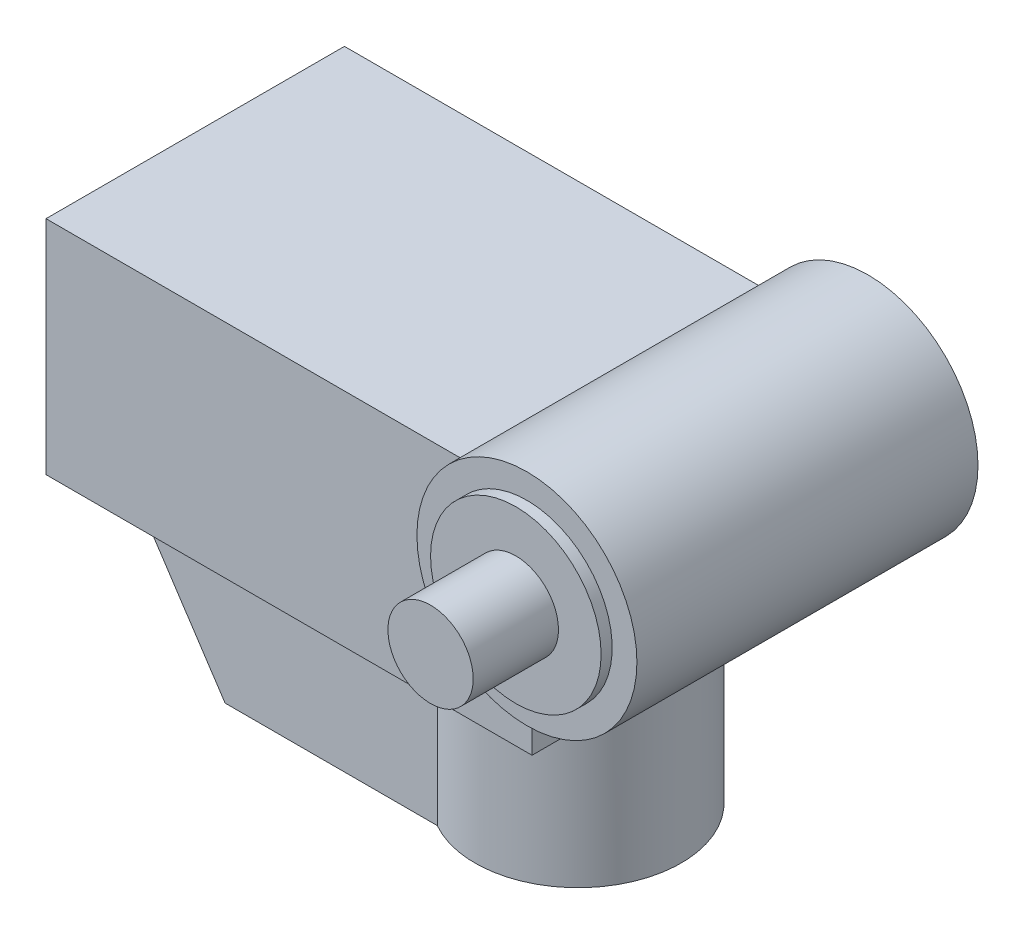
from build123d import *

# Parameters (mm, degrees)
EXTRUDE1_DEPTH     = 98.5
SKETCH2_R          = 25
CUT_EXTRUDE1_DEPTH = 50
CUT_EXTRUDE2_DEPTH = 266.803498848
SKETCH4_W          = 285
SKETCH4_H          = 175
EXTRUDE3_DEPTH     = 130
SKETCH5_R          = 64.5
EXTRUDE4_DEPTH     = 12.5
EXTRUDE5_START     = -187.5
SKETCH5_2_R        = 64.5
EXTRUDE5_DEPTH     = 187.5
SKETCH6_R          = 50
EXTRUDE6_DEPTH     = 6.5
SKETCH7_R          = 25
EXTRUDE7_DEPTH     = 50


with BuildPart() as part:
    # Sketch1 → Extrude1 (new body)
    with BuildSketch(Plane(origin=(0, 0, 0), x_dir=(1, 0, 0), z_dir=(0, 1, 0))):
        with BuildLine():
            Line((-219.5, 52.5), (-30.066592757, 52.5))
            ThreePointArc((-30.066592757, 52.5), (60.5, 0), (-30.066592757, -52.5))
            Line((-30.066592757, -52.5), (-219.5, -52.5))
            Line((-219.5, -52.5), (-219.5, 52.5))
        make_face()
    extrude(amount=EXTRUDE1_DEPTH)

    # Sketch2 → Cut-Extrude1 (cut)
    with BuildSketch(Plane.XZ):
        with Locations(Location((0, 0, 0), (0, 0, 270))):
            Circle(SKETCH2_R)
    extrude(amount=-CUT_EXTRUDE1_DEPTH, mode=Mode.SUBTRACT)

    # Sketch3 → Cut-Extrude2 (cut, through all)
    with BuildSketch(Plane.XY.offset(52.5)):
        Polygon((-219.5, 98.5), (-154.5, 0), (-219.5, 0), align=None)
    extrude(amount=-CUT_EXTRUDE2_DEPTH, mode=Mode.SUBTRACT)

    # Sketch4 → Extrude3 (add)
    with BuildSketch(Plane(origin=(0, 98.5, 0), x_dir=(-1, 0, 0), z_dir=(0, 1, 0))):
        with Locations((82, 0)):
            Rectangle(SKETCH4_W, SKETCH4_H)
    extrude(amount=EXTRUDE3_DEPTH)

    # Sketch5 → Extrude4 (add)
    with BuildSketch(Plane(origin=(0, 0, -87.5), x_dir=(-1, 0, 0), z_dir=(0, 0, -1))):
        with Locations((-70, 189)):
            Circle(SKETCH5_R)
    extrude(amount=EXTRUDE4_DEPTH)

    # Sketch5_2 → Extrude5 (add)
    with BuildSketch(Plane(origin=(0, 0, -87.5), x_dir=(-1, 0, 0), z_dir=(0, 0, -1)).offset(EXTRUDE5_START)):
        with Locations((-70, 189)):
            Circle(SKETCH5_2_R)
    extrude(amount=EXTRUDE5_DEPTH)

    # Sketch6 → Extrude6 (add)
    with BuildSketch(Plane.XY.offset(100)):
        with Locations(Location((70, 189, 0), (0, 0, 180))):
            Circle(SKETCH6_R)
    extrude(amount=EXTRUDE6_DEPTH)

    # Sketch7 → Extrude7 (add)
    with BuildSketch(Plane.XY.offset(106.5)):
        with Locations((70, 189)):
            Circle(SKETCH7_R)
    extrude(amount=EXTRUDE7_DEPTH)


solid = part.part
